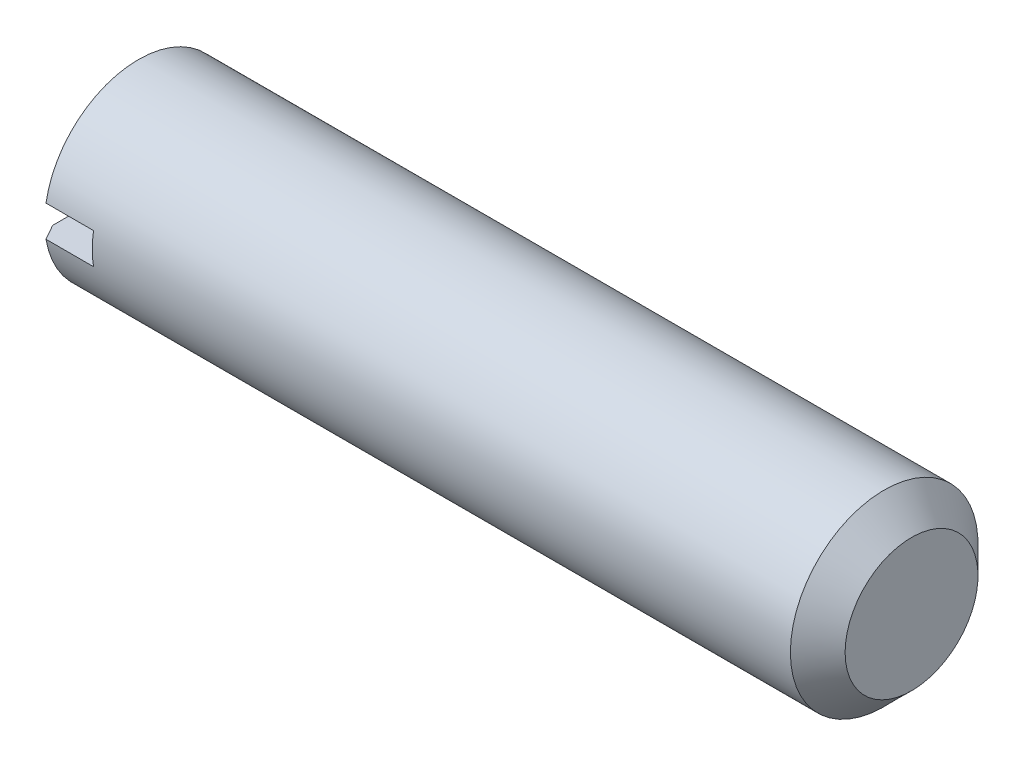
ISO-10303-21;
HEADER;
FILE_DESCRIPTION(('STEP AP214'),'2;1');
FILE_NAME('part.step','',(''),(''),'','','');
FILE_SCHEMA(('AUTOMOTIVE_DESIGN { 1 0 10303 214 1 1 1 1 }'));
ENDSEC;
DATA;
#1=APPLICATION_CONTEXT('core data for automotive mechanical design processes');
#2=APPLICATION_PROTOCOL_DEFINITION('international standard','automotive_design',2000,#1);
#3=PRODUCT_CONTEXT('',#1,'mechanical');
#4=PRODUCT('Part','Part','',(#3));
#5=PRODUCT_RELATED_PRODUCT_CATEGORY('part','',(#4));
#6=PRODUCT_DEFINITION_FORMATION('','',#4);
#7=PRODUCT_DEFINITION_CONTEXT('part definition',#1,'design');
#8=PRODUCT_DEFINITION('design','',#6,#7);
#9=PRODUCT_DEFINITION_SHAPE('','',#8);
#10=(LENGTH_UNIT() NAMED_UNIT(*) SI_UNIT(.MILLI.,.METRE.));
#11=(NAMED_UNIT(*) PLANE_ANGLE_UNIT() SI_UNIT($,.RADIAN.));
#12=(NAMED_UNIT(*) SI_UNIT($,.STERADIAN.) SOLID_ANGLE_UNIT());
#13=UNCERTAINTY_MEASURE_WITH_UNIT(LENGTH_MEASURE(1.E-05),#10,'distance_accuracy_value','');
#14=(GEOMETRIC_REPRESENTATION_CONTEXT(3) GLOBAL_UNCERTAINTY_ASSIGNED_CONTEXT((#13)) GLOBAL_UNIT_ASSIGNED_CONTEXT((#10,
#11,#12)) REPRESENTATION_CONTEXT('',''));
#15=CARTESIAN_POINT('',(0.,0.,0.));
#16=DIRECTION('',(0.,0.,1.));
#17=DIRECTION('',(1.,0.,0.));
#18=AXIS2_PLACEMENT_3D('',#15,#16,#17);
#19=CARTESIAN_POINT('',(0.,0.,0.));
#20=DIRECTION('',(-1.,0.,0.));
#21=DIRECTION('',(0.,0.,1.));
#22=AXIS2_PLACEMENT_3D('',#19,#20,#21);
#23=PLANE('',#22);
#24=CARTESIAN_POINT('',(0.,0.,0.));
#25=DIRECTION('',(-1.,0.,0.));
#26=DIRECTION('',(0.,0.,1.));
#27=AXIS2_PLACEMENT_3D('',#24,#25,#26);
#28=CIRCLE('',#27,5.036);
#29=CARTESIAN_POINT('',(0.,1.,4.93571636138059));
#30=VERTEX_POINT('',#29);
#31=CARTESIAN_POINT('',(0.,1.,-4.93571636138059));
#32=VERTEX_POINT('',#31);
#33=EDGE_CURVE('E107',#30,#32,#28,.T.);
#34=ORIENTED_EDGE('',*,*,#33,.T.);
#35=DIRECTION('',(0.,0.,1.));
#36=VECTOR('',#35,1.);
#37=CARTESIAN_POINT('',(0.,1.,-6.));
#38=LINE('',#37,#36);
#39=EDGE_CURVE('E174',#32,#30,#38,.T.);
#40=ORIENTED_EDGE('',*,*,#39,.T.);
#41=EDGE_LOOP('',(#34,#40));
#42=FACE_BOUND('',#41,.T.);
#43=ADVANCED_FACE('F34',(#42),#23,.T.);
#44=CARTESIAN_POINT('',(0.,-0.999999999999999,-4.93571636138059));
#45=VERTEX_POINT('',#44);
#46=CARTESIAN_POINT('',(0.,-1.,4.93571636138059));
#47=VERTEX_POINT('',#46);
#48=EDGE_CURVE('E103',#45,#47,#28,.T.);
#49=ORIENTED_EDGE('',*,*,#48,.T.);
#50=DIRECTION('',(0.,0.,-1.));
#51=VECTOR('',#50,1.);
#52=CARTESIAN_POINT('',(0.,-0.999999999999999,-6.));
#53=LINE('',#52,#51);
#54=EDGE_CURVE('E95',#47,#45,#53,.T.);
#55=ORIENTED_EDGE('',*,*,#54,.T.);
#56=EDGE_LOOP('',(#49,#55));
#57=FACE_BOUND('',#56,.T.);
#58=ADVANCED_FACE('F166',(#57),#23,.T.);
#59=CARTESIAN_POINT('',(0.,0.,0.));
#60=DIRECTION('',(1.,0.,0.));
#61=DIRECTION('',(0.,0.,-1.));
#62=AXIS2_PLACEMENT_3D('',#59,#60,#61);
#63=CONICAL_SURFACE('',#62,5.036,1.0471975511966);
#64=CARTESIAN_POINT('',(0.5565656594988,0.,0.));
#65=DIRECTION('',(-1.,0.,0.));
#66=DIRECTION('',(0.,0.,1.));
#67=AXIS2_PLACEMENT_3D('',#64,#65,#66);
#68=CIRCLE('',#67,6.);
#69=CARTESIAN_POINT('',(0.5565656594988,0.999999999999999,5.91607978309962));
#70=VERTEX_POINT('',#69);
#71=CARTESIAN_POINT('',(0.5565656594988,1.,-5.91607978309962));
#72=VERTEX_POINT('',#71);
#73=EDGE_CURVE('E100',#70,#72,#68,.T.);
#74=ORIENTED_EDGE('',*,*,#73,.T.);
#75=CARTESIAN_POINT('',(4.73989669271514,1.,-13.2079399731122));
#76=CARTESIAN_POINT('',(4.41853771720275,1.,-12.6497082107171));
#77=CARTESIAN_POINT('',(4.09724308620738,1.,-12.0914392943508));
#78=CARTESIAN_POINT('',(3.45491866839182,1.,-10.9747439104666));
#79=CARTESIAN_POINT('',(3.13388888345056,1.,-10.416317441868));
#80=CARTESIAN_POINT('',(2.49197762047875,1.,-9.29878375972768));
#81=CARTESIAN_POINT('',(2.17109646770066,1.,-8.73967635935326));
#82=CARTESIAN_POINT('',(1.53002759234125,1.,-7.62106803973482));
#83=CARTESIAN_POINT('',(1.2098398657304,1.,-7.0615671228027));
#84=CARTESIAN_POINT('',(0.731752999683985,1.,-6.22374471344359));
#85=CARTESIAN_POINT('',(0.573331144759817,1.,-5.94572157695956));
#86=CARTESIAN_POINT('',(0.25700680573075,1.,-5.38937510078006));
#87=CARTESIAN_POINT('',(0.0991043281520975,1.,-5.11105175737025));
#88=CARTESIAN_POINT('',(-0.215803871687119,1.,-4.5540578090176));
#89=CARTESIAN_POINT('',(-0.372809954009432,1.,-4.27538740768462));
#90=CARTESIAN_POINT('',(-0.685421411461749,1.,-3.71727146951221));
#91=CARTESIAN_POINT('',(-0.841026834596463,1.,-3.43782595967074));
#92=CARTESIAN_POINT('',(-1.07280047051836,1.,-3.01670739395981));
#93=CARTESIAN_POINT('',(-1.15000341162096,1.,-2.87560489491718));
#94=CARTESIAN_POINT('',(-1.30334590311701,1.,-2.59280771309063));
#95=CARTESIAN_POINT('',(-1.37948536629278,1.,-2.45111298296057));
#96=CARTESIAN_POINT('',(-1.53019389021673,1.,-2.16666998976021));
#97=CARTESIAN_POINT('',(-1.60476099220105,1.,-2.02392068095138));
#98=CARTESIAN_POINT('',(-1.71445658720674,1.,-1.80870871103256));
#99=CARTESIAN_POINT('',(-1.75066016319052,1.,-1.73679509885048));
#100=CARTESIAN_POINT('',(-1.82208482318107,1.,-1.59248261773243));
#101=CARTESIAN_POINT('',(-1.85730593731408,1.,-1.52008376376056));
#102=CARTESIAN_POINT('',(-1.92735529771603,1.,-1.37261463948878));
#103=CARTESIAN_POINT('',(-1.96214530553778,1.,-1.29752611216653));
#104=CARTESIAN_POINT('',(-2.02965956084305,1.,-1.1464272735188));
#105=CARTESIAN_POINT('',(-2.06238404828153,1.,-1.07041707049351));
#106=CARTESIAN_POINT('',(-2.12476431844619,1.,-0.917145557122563));
#107=CARTESIAN_POINT('',(-2.15442052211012,1.,-0.83988442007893));
#108=CARTESIAN_POINT('',(-2.20906255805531,1.,-0.683706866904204));
#109=CARTESIAN_POINT('',(-2.23405029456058,1.,-0.604791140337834));
#110=CARTESIAN_POINT('',(-2.2701858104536,1.,-0.470093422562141));
#111=CARTESIAN_POINT('',(-2.28321589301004,1.,-0.414824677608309));
#112=CARTESIAN_POINT('',(-2.3049462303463,1.,-0.303453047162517));
#113=CARTESIAN_POINT('',(-2.31364920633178,1.,-0.247350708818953));
#114=CARTESIAN_POINT('',(-2.32581520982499,1.,-0.134957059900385));
#115=CARTESIAN_POINT('',(-2.32931440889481,1.,-0.0786698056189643));
#116=CARTESIAN_POINT('',(-2.33076867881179,1.,0.0339758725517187));
#117=CARTESIAN_POINT('',(-2.32872385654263,1.,0.0903342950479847));
#118=CARTESIAN_POINT('',(-2.31805799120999,1.,0.217768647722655));
#119=CARTESIAN_POINT('',(-2.30780921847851,1.,0.288706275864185));
#120=CARTESIAN_POINT('',(-2.28041448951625,1.,0.429255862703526));
#121=CARTESIAN_POINT('',(-2.26326048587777,1.,0.498866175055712));
#122=CARTESIAN_POINT('',(-2.2336732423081,1.,0.602653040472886));
#123=CARTESIAN_POINT('',(-2.22308279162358,1.,0.637377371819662));
#124=CARTESIAN_POINT('',(-2.20083833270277,1.,0.706460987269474));
#125=CARTESIAN_POINT('',(-2.18918499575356,1.,0.740820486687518));
#126=CARTESIAN_POINT('',(-2.16499431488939,1.,0.809218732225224));
#127=CARTESIAN_POINT('',(-2.15245710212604,1.,0.843257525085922));
#128=CARTESIAN_POINT('',(-2.12664333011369,1.,0.911058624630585));
#129=CARTESIAN_POINT('',(-2.11336665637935,1.,0.944820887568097));
#130=CARTESIAN_POINT('',(-2.06998388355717,1.,1.05227293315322));
#131=CARTESIAN_POINT('',(-2.03871498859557,1.,1.1254929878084));
#132=CARTESIAN_POINT('',(-1.97418773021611,1.,1.27105481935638));
#133=CARTESIAN_POINT('',(-1.94092900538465,1.,1.34339643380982));
#134=CARTESIAN_POINT('',(-1.87300145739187,1.,1.48745172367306));
#135=CARTESIAN_POINT('',(-1.83833201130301,1.,1.55916510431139));
#136=CARTESIAN_POINT('',(-1.76798292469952,1.,1.7020957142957));
#137=CARTESIAN_POINT('',(-1.73230324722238,1.,1.77331292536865));
#138=CARTESIAN_POINT('',(-1.62404833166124,1.,1.98662313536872));
#139=CARTESIAN_POINT('',(-1.55036430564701,1.,2.12815237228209));
#140=CARTESIAN_POINT('',(-1.40130813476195,1.,2.41025810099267));
#141=CARTESIAN_POINT('',(-1.32593649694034,1.,2.55083486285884));
#142=CARTESIAN_POINT('',(-1.17450983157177,1.,2.83063597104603));
#143=CARTESIAN_POINT('',(-1.0984607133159,1.,2.96986351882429));
#144=CARTESIAN_POINT('',(-0.945628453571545,1.,3.24792809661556));
#145=CARTESIAN_POINT('',(-0.868845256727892,1.,3.38676509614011));
#146=CARTESIAN_POINT('',(-0.637891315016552,1.,3.80258527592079));
#147=CARTESIAN_POINT('',(-0.482967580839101,1.,4.07914988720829));
#148=CARTESIAN_POINT('',(-0.119566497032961,1.,4.72494312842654));
#149=CARTESIAN_POINT('',(0.0893330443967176,0.999999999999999,5.09393352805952));
#150=CARTESIAN_POINT('',(0.50813116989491,0.999999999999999,5.8313517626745));
#151=CARTESIAN_POINT('',(0.718029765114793,0.999999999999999,6.1997795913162));
#152=CARTESIAN_POINT('',(1.13850339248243,0.999999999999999,6.93645171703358));
#153=CARTESIAN_POINT('',(1.34907866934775,0.999999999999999,7.30469587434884));
#154=CARTESIAN_POINT('',(1.77060223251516,0.999999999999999,8.04096877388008));
#155=CARTESIAN_POINT('',(1.98155051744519,0.999999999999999,8.40899751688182));
#156=CARTESIAN_POINT('',(2.40459995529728,0.999999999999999,9.14648067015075));
#157=CARTESIAN_POINT('',(2.61670218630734,0.999999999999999,9.51593446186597));
#158=CARTESIAN_POINT('',(3.04108596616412,0.999999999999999,10.2547396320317));
#159=CARTESIAN_POINT('',(3.25336751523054,0.999999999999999,10.624091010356));
#160=CARTESIAN_POINT('',(3.67796813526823,0.999999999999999,11.3625576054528));
#161=CARTESIAN_POINT('',(3.8902871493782,0.999999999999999,11.7316728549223));
#162=CARTESIAN_POINT('',(4.31502474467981,0.999999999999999,12.4698454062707));
#163=CARTESIAN_POINT('',(4.52744332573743,0.999999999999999,12.8389027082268));
#164=CARTESIAN_POINT('',(4.73989669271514,0.999999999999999,13.2079399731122));
#165=B_SPLINE_CURVE_WITH_KNOTS('',3,(#75,#76,#77,#78,#79,#80,#81,#82,#83,#84,#85,#86,#87,#88,
#89,#90,#91,#92,#93,#94,#95,#96,#97,#98,#99,#100,#101,#102,#103,#104,#105,#106,#107,#108,#109,
#110,#111,#112,#113,#114,#115,#116,#117,#118,#119,#120,#121,#122,#123,#124,#125,#126,#127,#128,
#129,#130,#131,#132,#133,#134,#135,#136,#137,#138,#139,#140,#141,#142,#143,#144,#145,#146,#147,
#148,#149,#150,#151,#152,#153,#154,#155,#156,#157,#158,#159,#160,#161,#162,#163,#164),
.UNSPECIFIED.,.F.,.F.,(4,2,2,2,2,2,2,2,2,2,2,2,2,2,2,2,2,2,2,2,2,2,2,2,2,2,2,2,2,2,2,2,2,2,2,2,
2,2,2,2,2,2,2,2,4),(0.,1.93236881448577,3.86475122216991,5.79868288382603,7.73260327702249,
8.69257649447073,9.65256172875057,10.612129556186,11.5716643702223,12.054187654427,
12.5367502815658,13.019882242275,13.2614145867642,13.5029395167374,13.7511887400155,
13.9994090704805,14.2475953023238,14.4956800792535,14.6658994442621,14.8360116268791,
15.0049357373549,15.1738565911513,15.3884236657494,15.6032415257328,15.7121389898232,
15.8209681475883,15.9297811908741,16.0386111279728,16.2774120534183,16.5162564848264,
16.7552075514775,16.9941673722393,17.4728272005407,17.9513450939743,18.4272722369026,
18.903235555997,19.8542316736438,21.1262890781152,22.3983607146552,23.6709606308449,
24.943555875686,26.2215820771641,27.4996098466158,28.7770795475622,30.0545475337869),.UNSPECIFIED.);
#166=EDGE_CURVE('E128',#72,#32,#165,.T.);
#167=ORIENTED_EDGE('',*,*,#166,.T.);
#168=ORIENTED_EDGE('',*,*,#33,.F.);
#169=EDGE_CURVE('E130',#30,#70,#165,.T.);
#170=ORIENTED_EDGE('',*,*,#169,.T.);
#171=EDGE_LOOP('',(#74,#167,#168,#170));
#172=FACE_BOUND('',#171,.T.);
#173=ADVANCED_FACE('F142',(#172),#63,.T.);
#174=CARTESIAN_POINT('',(0.5565656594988,-0.999999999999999,-5.91607978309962));
#175=VERTEX_POINT('',#174);
#176=CARTESIAN_POINT('',(0.5565656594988,-1.,5.91607978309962));
#177=VERTEX_POINT('',#176);
#178=EDGE_CURVE('E104',#175,#177,#68,.T.);
#179=ORIENTED_EDGE('',*,*,#178,.T.);
#180=CARTESIAN_POINT('',(4.73989669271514,-1.,13.2079399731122));
#181=CARTESIAN_POINT('',(4.41853771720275,-1.,12.649708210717));
#182=CARTESIAN_POINT('',(4.09724308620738,-1.,12.0914392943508));
#183=CARTESIAN_POINT('',(3.45491866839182,-1.,10.9747439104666));
#184=CARTESIAN_POINT('',(3.13388888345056,-1.,10.416317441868));
#185=CARTESIAN_POINT('',(2.49197762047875,-1.,9.29878375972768));
#186=CARTESIAN_POINT('',(2.17109646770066,-1.,8.73967635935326));
#187=CARTESIAN_POINT('',(1.53002759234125,-1.,7.62106803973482));
#188=CARTESIAN_POINT('',(1.2098398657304,-1.,7.0615671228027));
#189=CARTESIAN_POINT('',(0.731752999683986,-1.,6.2237447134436));
#190=CARTESIAN_POINT('',(0.573331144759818,-1.,5.94572157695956));
#191=CARTESIAN_POINT('',(0.257006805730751,-1.,5.38937510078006));
#192=CARTESIAN_POINT('',(0.0991043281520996,-1.,5.11105175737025));
#193=CARTESIAN_POINT('',(-0.215803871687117,-1.,4.55405780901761));
#194=CARTESIAN_POINT('',(-0.372809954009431,-1.,4.27538740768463));
#195=CARTESIAN_POINT('',(-0.685421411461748,-1.,3.71727146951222));
#196=CARTESIAN_POINT('',(-0.841026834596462,-1.,3.43782595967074));
#197=CARTESIAN_POINT('',(-1.07280047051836,-1.,3.01670739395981));
#198=CARTESIAN_POINT('',(-1.15000341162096,-1.,2.87560489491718));
#199=CARTESIAN_POINT('',(-1.30334590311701,-1.,2.59280771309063));
#200=CARTESIAN_POINT('',(-1.37948536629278,-1.,2.45111298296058));
#201=CARTESIAN_POINT('',(-1.53019389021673,-1.,2.16666998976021));
#202=CARTESIAN_POINT('',(-1.60476099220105,-1.,2.02392068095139));
#203=CARTESIAN_POINT('',(-1.71445658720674,-1.,1.80870871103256));
#204=CARTESIAN_POINT('',(-1.75066016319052,-1.,1.73679509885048));
#205=CARTESIAN_POINT('',(-1.82208482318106,-1.,1.59248261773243));
#206=CARTESIAN_POINT('',(-1.85730593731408,-1.,1.52008376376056));
#207=CARTESIAN_POINT('',(-1.92735529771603,-1.,1.37261463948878));
#208=CARTESIAN_POINT('',(-1.96214530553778,-1.,1.29752611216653));
#209=CARTESIAN_POINT('',(-2.02965956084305,-1.,1.1464272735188));
#210=CARTESIAN_POINT('',(-2.06238404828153,-1.,1.07041707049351));
#211=CARTESIAN_POINT('',(-2.12476431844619,-1.,0.917145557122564));
#212=CARTESIAN_POINT('',(-2.15442052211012,-1.,0.839884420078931));
#213=CARTESIAN_POINT('',(-2.2090625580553,-1.,0.683706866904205));
#214=CARTESIAN_POINT('',(-2.23405029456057,-1.,0.604791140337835));
#215=CARTESIAN_POINT('',(-2.2701858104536,-1.,0.470093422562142));
#216=CARTESIAN_POINT('',(-2.28321589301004,-1.,0.41482467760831));
#217=CARTESIAN_POINT('',(-2.3049462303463,-1.,0.303453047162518));
#218=CARTESIAN_POINT('',(-2.31364920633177,-1.,0.247350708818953));
#219=CARTESIAN_POINT('',(-2.32581520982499,-1.,0.134957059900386));
#220=CARTESIAN_POINT('',(-2.32931440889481,-1.,0.0786698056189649));
#221=CARTESIAN_POINT('',(-2.33076867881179,-1.,-0.0339758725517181));
#222=CARTESIAN_POINT('',(-2.32872385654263,-1.,-0.0903342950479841));
#223=CARTESIAN_POINT('',(-2.31805799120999,-1.,-0.217768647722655));
#224=CARTESIAN_POINT('',(-2.30780921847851,-1.,-0.288706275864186));
#225=CARTESIAN_POINT('',(-2.28041448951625,-1.,-0.429255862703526));
#226=CARTESIAN_POINT('',(-2.26326048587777,-1.,-0.498866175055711));
#227=CARTESIAN_POINT('',(-2.2336732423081,-1.,-0.602653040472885));
#228=CARTESIAN_POINT('',(-2.22308279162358,-1.,-0.637377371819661));
#229=CARTESIAN_POINT('',(-2.20083833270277,-1.,-0.706460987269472));
#230=CARTESIAN_POINT('',(-2.18918499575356,-1.,-0.740820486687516));
#231=CARTESIAN_POINT('',(-2.16499431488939,-1.,-0.809218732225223));
#232=CARTESIAN_POINT('',(-2.15245710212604,-1.,-0.843257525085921));
#233=CARTESIAN_POINT('',(-2.12664333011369,-1.,-0.911058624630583));
#234=CARTESIAN_POINT('',(-2.11336665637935,-1.,-0.944820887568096));
#235=CARTESIAN_POINT('',(-2.06998388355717,-1.,-1.05227293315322));
#236=CARTESIAN_POINT('',(-2.03871498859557,-1.,-1.12549298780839));
#237=CARTESIAN_POINT('',(-1.97418773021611,-1.,-1.27105481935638));
#238=CARTESIAN_POINT('',(-1.94092900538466,-1.,-1.34339643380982));
#239=CARTESIAN_POINT('',(-1.87300145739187,-1.,-1.48745172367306));
#240=CARTESIAN_POINT('',(-1.83833201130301,-1.,-1.55916510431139));
#241=CARTESIAN_POINT('',(-1.76798292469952,-1.,-1.7020957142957));
#242=CARTESIAN_POINT('',(-1.73230324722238,-1.,-1.77331292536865));
#243=CARTESIAN_POINT('',(-1.62404833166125,-1.,-1.98662313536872));
#244=CARTESIAN_POINT('',(-1.55036430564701,-1.,-2.12815237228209));
#245=CARTESIAN_POINT('',(-1.40130813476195,-1.,-2.41025810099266));
#246=CARTESIAN_POINT('',(-1.32593649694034,-1.,-2.55083486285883));
#247=CARTESIAN_POINT('',(-1.17450983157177,-1.,-2.83063597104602));
#248=CARTESIAN_POINT('',(-1.09846071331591,-1.,-2.96986351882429));
#249=CARTESIAN_POINT('',(-0.945628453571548,-1.,-3.24792809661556));
#250=CARTESIAN_POINT('',(-0.868845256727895,-1.,-3.3867650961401));
#251=CARTESIAN_POINT('',(-0.637891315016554,-0.999999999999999,-3.80258527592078));
#252=CARTESIAN_POINT('',(-0.482967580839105,-1.,-4.07914988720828));
#253=CARTESIAN_POINT('',(-0.119566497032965,-1.,-4.72494312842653));
#254=CARTESIAN_POINT('',(0.0893330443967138,-0.999999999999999,-5.09393352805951));
#255=CARTESIAN_POINT('',(0.508131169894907,-0.999999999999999,-5.83135176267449));
#256=CARTESIAN_POINT('',(0.718029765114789,-0.999999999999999,-6.1997795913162));
#257=CARTESIAN_POINT('',(1.13850339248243,-0.999999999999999,-6.93645171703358));
#258=CARTESIAN_POINT('',(1.34907866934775,-0.999999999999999,-7.30469587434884));
#259=CARTESIAN_POINT('',(1.77060223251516,-0.999999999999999,-8.04096877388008));
#260=CARTESIAN_POINT('',(1.98155051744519,-0.999999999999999,-8.40899751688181));
#261=CARTESIAN_POINT('',(2.40459995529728,-0.999999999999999,-9.14648067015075));
#262=CARTESIAN_POINT('',(2.61670218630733,-0.999999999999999,-9.51593446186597));
#263=CARTESIAN_POINT('',(3.04108596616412,-0.999999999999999,-10.2547396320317));
#264=CARTESIAN_POINT('',(3.25336751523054,-0.999999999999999,-10.624091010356));
#265=CARTESIAN_POINT('',(3.67796813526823,-0.999999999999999,-11.3625576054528));
#266=CARTESIAN_POINT('',(3.8902871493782,-0.999999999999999,-11.7316728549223));
#267=CARTESIAN_POINT('',(4.31502474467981,-0.999999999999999,-12.4698454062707));
#268=CARTESIAN_POINT('',(4.52744332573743,-0.999999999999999,-12.8389027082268));
#269=CARTESIAN_POINT('',(4.73989669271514,-0.999999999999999,-13.2079399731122));
#270=B_SPLINE_CURVE_WITH_KNOTS('',3,(#180,#181,#182,#183,#184,#185,#186,#187,#188,#189,#190,
#191,#192,#193,#194,#195,#196,#197,#198,#199,#200,#201,#202,#203,#204,#205,#206,#207,#208,#209,
#210,#211,#212,#213,#214,#215,#216,#217,#218,#219,#220,#221,#222,#223,#224,#225,#226,#227,#228,
#229,#230,#231,#232,#233,#234,#235,#236,#237,#238,#239,#240,#241,#242,#243,#244,#245,#246,#247,
#248,#249,#250,#251,#252,#253,#254,#255,#256,#257,#258,#259,#260,#261,#262,#263,#264,#265,#266,
#267,#268,#269),.UNSPECIFIED.,.F.,.F.,(4,2,2,2,2,2,2,2,2,2,2,2,2,2,2,2,2,2,2,2,2,2,2,2,2,2,2,2,
2,2,2,2,2,2,2,2,2,2,2,2,2,2,2,2,4),(0.,1.93236881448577,3.86475122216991,5.79868288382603,
7.73260327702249,8.69257649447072,9.65256172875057,10.612129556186,11.5716643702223,
12.054187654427,12.5367502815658,13.019882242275,13.2614145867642,13.5029395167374,
13.7511887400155,13.9994090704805,14.2475953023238,14.4956800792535,14.6658994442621,
14.8360116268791,15.0049357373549,15.1738565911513,15.3884236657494,15.6032415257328,
15.7121389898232,15.8209681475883,15.9297811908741,16.0386111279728,16.2774120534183,
16.5162564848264,16.7552075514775,16.9941673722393,17.4728272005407,17.9513450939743,
18.4272722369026,18.903235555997,19.8542316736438,21.1262890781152,22.3983607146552,
23.6709606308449,24.943555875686,26.2215820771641,27.4996098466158,28.7770795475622,
30.0545475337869),.UNSPECIFIED.);
#271=EDGE_CURVE('E125',#177,#47,#270,.T.);
#272=ORIENTED_EDGE('',*,*,#271,.T.);
#273=ORIENTED_EDGE('',*,*,#48,.F.);
#274=EDGE_CURVE('E126',#45,#175,#270,.T.);
#275=ORIENTED_EDGE('',*,*,#274,.T.);
#276=EDGE_LOOP('',(#179,#272,#273,#275));
#277=FACE_BOUND('',#276,.T.);
#278=ADVANCED_FACE('F123',(#277),#63,.T.);
#279=CARTESIAN_POINT('',(-12.7,0.,0.));
#280=DIRECTION('',(-1.,0.,0.));
#281=DIRECTION('',(0.,0.,1.));
#282=AXIS2_PLACEMENT_3D('',#279,#280,#281);
#283=CYLINDRICAL_SURFACE('',#282,6.);
#284=CARTESIAN_POINT('',(48.25,0.,0.));
#285=DIRECTION('',(-1.,0.,0.));
#286=DIRECTION('',(0.,0.,1.));
#287=AXIS2_PLACEMENT_3D('',#284,#285,#286);
#288=CIRCLE('',#287,6.);
#289=CARTESIAN_POINT('',(48.25,0.,6.));
#290=VERTEX_POINT('',#289);
#291=EDGE_CURVE('E110',#290,#290,#288,.T.);
#292=ORIENTED_EDGE('',*,*,#291,.T.);
#293=EDGE_LOOP('',(#292));
#294=FACE_BOUND('',#293,.T.);
#295=ORIENTED_EDGE('',*,*,#73,.F.);
#296=DIRECTION('',(-1.,0.,0.));
#297=VECTOR('',#296,1.);
#298=CARTESIAN_POINT('',(-12.7,0.999999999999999,5.91607978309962));
#299=LINE('',#298,#297);
#300=CARTESIAN_POINT('',(3.6,0.999999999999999,5.91607978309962));
#301=VERTEX_POINT('',#300);
#302=EDGE_CURVE('E11',#70,#301,#299,.F.);
#303=ORIENTED_EDGE('',*,*,#302,.T.);
#304=CARTESIAN_POINT('',(3.6,0.,0.));
#305=DIRECTION('',(1.,0.,0.));
#306=DIRECTION('',(0.,0.,-1.));
#307=AXIS2_PLACEMENT_3D('',#304,#305,#306);
#308=CIRCLE('',#307,6.);
#309=CARTESIAN_POINT('',(3.6,-1.,5.91607978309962));
#310=VERTEX_POINT('',#309);
#311=EDGE_CURVE('E82',#310,#301,#308,.F.);
#312=ORIENTED_EDGE('',*,*,#311,.F.);
#313=DIRECTION('',(-1.,0.,0.));
#314=VECTOR('',#313,1.);
#315=CARTESIAN_POINT('',(-12.7,-1.,5.91607978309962));
#316=LINE('',#315,#314);
#317=EDGE_CURVE('E41',#310,#177,#316,.T.);
#318=ORIENTED_EDGE('',*,*,#317,.T.);
#319=ORIENTED_EDGE('',*,*,#178,.F.);
#320=DIRECTION('',(-1.,0.,0.));
#321=VECTOR('',#320,1.);
#322=CARTESIAN_POINT('',(-12.7,-0.999999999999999,-5.91607978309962));
#323=LINE('',#322,#321);
#324=CARTESIAN_POINT('',(3.6,-0.999999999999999,-5.91607978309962));
#325=VERTEX_POINT('',#324);
#326=EDGE_CURVE('E115',#175,#325,#323,.F.);
#327=ORIENTED_EDGE('',*,*,#326,.T.);
#328=CARTESIAN_POINT('',(3.6,1.,-5.91607978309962));
#329=VERTEX_POINT('',#328);
#330=EDGE_CURVE('E91',#329,#325,#308,.F.);
#331=ORIENTED_EDGE('',*,*,#330,.F.);
#332=DIRECTION('',(-1.,0.,0.));
#333=VECTOR('',#332,1.);
#334=CARTESIAN_POINT('',(-12.7,1.,-5.91607978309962));
#335=LINE('',#334,#333);
#336=EDGE_CURVE('E89',#329,#72,#335,.T.);
#337=ORIENTED_EDGE('',*,*,#336,.T.);
#338=EDGE_LOOP('',(#295,#303,#312,#318,#319,#327,#331,#337));
#339=FACE_BOUND('',#338,.T.);
#340=ADVANCED_FACE('F98',(#294,#339),#283,.T.);
#341=CARTESIAN_POINT('',(50.,0.,0.));
#342=DIRECTION('',(-1.,0.,0.));
#343=DIRECTION('',(0.,0.,1.));
#344=AXIS2_PLACEMENT_3D('',#341,#342,#343);
#345=CONICAL_SURFACE('',#344,4.25,0.78539816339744);
#346=ORIENTED_EDGE('',*,*,#291,.F.);
#347=EDGE_LOOP('',(#346));
#348=FACE_BOUND('',#347,.T.);
#349=CARTESIAN_POINT('',(50.,0.,0.));
#350=DIRECTION('',(-1.,0.,0.));
#351=DIRECTION('',(0.,0.,1.));
#352=AXIS2_PLACEMENT_3D('',#349,#350,#351);
#353=CIRCLE('',#352,4.25);
#354=CARTESIAN_POINT('',(50.,0.,4.25));
#355=VERTEX_POINT('',#354);
#356=EDGE_CURVE('E176',#355,#355,#353,.T.);
#357=ORIENTED_EDGE('',*,*,#356,.T.);
#358=EDGE_LOOP('',(#357));
#359=FACE_BOUND('',#358,.T.);
#360=ADVANCED_FACE('F155',(#348,#359),#345,.T.);
#361=CARTESIAN_POINT('',(50.,0.,0.));
#362=DIRECTION('',(-1.,0.,0.));
#363=DIRECTION('',(0.,0.,1.));
#364=AXIS2_PLACEMENT_3D('',#361,#362,#363);
#365=PLANE('',#364);
#366=ORIENTED_EDGE('',*,*,#356,.F.);
#367=EDGE_LOOP('',(#366));
#368=FACE_BOUND('',#367,.T.);
#369=ADVANCED_FACE('F152',(#368),#365,.F.);
#370=CARTESIAN_POINT('',(3.6,1.,-6.));
#371=DIRECTION('',(0.,-1.,0.));
#372=DIRECTION('',(0.,0.,-1.));
#373=AXIS2_PLACEMENT_3D('',#370,#371,#372);
#374=PLANE('',#373);
#375=ORIENTED_EDGE('',*,*,#39,.F.);
#376=ORIENTED_EDGE('',*,*,#166,.F.);
#377=ORIENTED_EDGE('',*,*,#336,.F.);
#378=DIRECTION('',(0.,0.,1.));
#379=VECTOR('',#378,1.);
#380=CARTESIAN_POINT('',(3.6,1.,-6.));
#381=LINE('',#380,#379);
#382=EDGE_CURVE('E48',#329,#301,#381,.T.);
#383=ORIENTED_EDGE('',*,*,#382,.T.);
#384=ORIENTED_EDGE('',*,*,#302,.F.);
#385=ORIENTED_EDGE('',*,*,#169,.F.);
#386=EDGE_LOOP('',(#375,#376,#377,#383,#384,#385));
#387=FACE_BOUND('',#386,.T.);
#388=ADVANCED_FACE('F92',(#387),#374,.T.);
#389=CARTESIAN_POINT('',(3.6,-0.999999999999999,-6.));
#390=DIRECTION('',(0.,1.,0.));
#391=DIRECTION('',(0.,0.,1.));
#392=AXIS2_PLACEMENT_3D('',#389,#390,#391);
#393=PLANE('',#392);
#394=ORIENTED_EDGE('',*,*,#54,.F.);
#395=ORIENTED_EDGE('',*,*,#271,.F.);
#396=ORIENTED_EDGE('',*,*,#317,.F.);
#397=DIRECTION('',(0.,0.,-1.));
#398=VECTOR('',#397,1.);
#399=CARTESIAN_POINT('',(3.6,-0.999999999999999,-6.));
#400=LINE('',#399,#398);
#401=EDGE_CURVE('E85',#310,#325,#400,.T.);
#402=ORIENTED_EDGE('',*,*,#401,.T.);
#403=ORIENTED_EDGE('',*,*,#326,.F.);
#404=ORIENTED_EDGE('',*,*,#274,.F.);
#405=EDGE_LOOP('',(#394,#395,#396,#402,#403,#404));
#406=FACE_BOUND('',#405,.T.);
#407=ADVANCED_FACE('F145',(#406),#393,.T.);
#408=CARTESIAN_POINT('',(3.6,1.,-6.));
#409=DIRECTION('',(1.,0.,0.));
#410=DIRECTION('',(0.,0.,-1.));
#411=AXIS2_PLACEMENT_3D('',#408,#409,#410);
#412=PLANE('',#411);
#413=ORIENTED_EDGE('',*,*,#401,.F.);
#414=ORIENTED_EDGE('',*,*,#311,.T.);
#415=ORIENTED_EDGE('',*,*,#382,.F.);
#416=ORIENTED_EDGE('',*,*,#330,.T.);
#417=EDGE_LOOP('',(#413,#414,#415,#416));
#418=FACE_BOUND('',#417,.T.);
#419=ADVANCED_FACE('F83',(#418),#412,.F.);
#420=CLOSED_SHELL('',(#43,#58,#173,#278,#340,#360,#369,#388,#407,#419));
#421=MANIFOLD_SOLID_BREP('B2',#420);
#422=ADVANCED_BREP_SHAPE_REPRESENTATION('',(#18,#421),#14);
#423=SHAPE_DEFINITION_REPRESENTATION(#9,#422);
ENDSEC;
END-ISO-10303-21;
